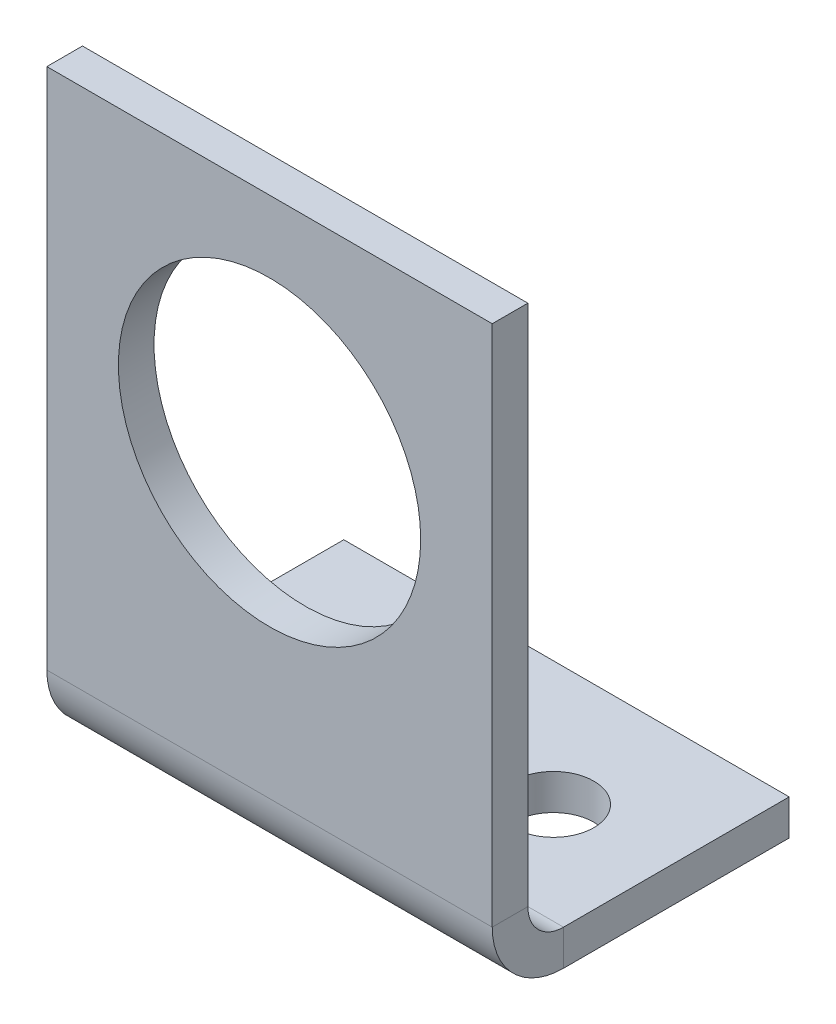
ISO-10303-21;
HEADER;
FILE_DESCRIPTION(('STEP AP214'),'2;1');
FILE_NAME('part.step','',(''),(''),'','','');
FILE_SCHEMA(('AUTOMOTIVE_DESIGN { 1 0 10303 214 1 1 1 1 }'));
ENDSEC;
DATA;
#1=APPLICATION_CONTEXT('core data for automotive mechanical design processes');
#2=APPLICATION_PROTOCOL_DEFINITION('international standard','automotive_design',2000,#1);
#3=PRODUCT_CONTEXT('',#1,'mechanical');
#4=PRODUCT('Part','Part','',(#3));
#5=PRODUCT_RELATED_PRODUCT_CATEGORY('part','',(#4));
#6=PRODUCT_DEFINITION_FORMATION('','',#4);
#7=PRODUCT_DEFINITION_CONTEXT('part definition',#1,'design');
#8=PRODUCT_DEFINITION('design','',#6,#7);
#9=PRODUCT_DEFINITION_SHAPE('','',#8);
#10=(LENGTH_UNIT() NAMED_UNIT(*) SI_UNIT(.MILLI.,.METRE.));
#11=(NAMED_UNIT(*) PLANE_ANGLE_UNIT() SI_UNIT($,.RADIAN.));
#12=(NAMED_UNIT(*) SI_UNIT($,.STERADIAN.) SOLID_ANGLE_UNIT());
#13=UNCERTAINTY_MEASURE_WITH_UNIT(LENGTH_MEASURE(1.E-05),#10,'distance_accuracy_value','');
#14=(GEOMETRIC_REPRESENTATION_CONTEXT(3) GLOBAL_UNCERTAINTY_ASSIGNED_CONTEXT((#13)) GLOBAL_UNIT_ASSIGNED_CONTEXT((#10,
#11,#12)) REPRESENTATION_CONTEXT('',''));
#15=CARTESIAN_POINT('',(0.,0.,0.));
#16=DIRECTION('',(0.,0.,1.));
#17=DIRECTION('',(1.,0.,0.));
#18=AXIS2_PLACEMENT_3D('',#15,#16,#17);
#19=CARTESIAN_POINT('',(9.525,3.048,0.));
#20=DIRECTION('',(1.,0.,0.));
#21=DIRECTION('',(0.,0.,-1.));
#22=AXIS2_PLACEMENT_3D('',#19,#20,#21);
#23=PLANE('',#22);
#24=DIRECTION('',(0.,0.,-1.));
#25=VECTOR('',#24,1.);
#26=CARTESIAN_POINT('',(9.525,3.048,0.));
#27=LINE('',#26,#25);
#28=CARTESIAN_POINT('',(9.525,3.048,0.));
#29=VERTEX_POINT('',#28);
#30=CARTESIAN_POINT('',(9.525,3.048,-1.524));
#31=VERTEX_POINT('',#30);
#32=EDGE_CURVE('E11',#29,#31,#27,.T.);
#33=ORIENTED_EDGE('',*,*,#32,.F.);
#34=CARTESIAN_POINT('',(9.525,3.048,-3.048));
#35=DIRECTION('',(1.,0.,0.));
#36=DIRECTION('',(0.,0.,-1.));
#37=AXIS2_PLACEMENT_3D('',#34,#35,#36);
#38=CIRCLE('',#37,3.048);
#39=CARTESIAN_POINT('',(9.525,0.,-3.048));
#40=VERTEX_POINT('',#39);
#41=EDGE_CURVE('E134',#40,#29,#38,.F.);
#42=ORIENTED_EDGE('',*,*,#41,.F.);
#43=DIRECTION('',(0.,-1.,0.));
#44=VECTOR('',#43,1.);
#45=CARTESIAN_POINT('',(9.525,1.524,-3.048));
#46=LINE('',#45,#44);
#47=CARTESIAN_POINT('',(9.525,1.524,-3.048));
#48=VERTEX_POINT('',#47);
#49=EDGE_CURVE('E45',#48,#40,#46,.T.);
#50=ORIENTED_EDGE('',*,*,#49,.F.);
#51=CARTESIAN_POINT('',(9.525,3.048,-3.048));
#52=DIRECTION('',(1.,0.,0.));
#53=DIRECTION('',(0.,0.,-1.));
#54=AXIS2_PLACEMENT_3D('',#51,#52,#53);
#55=CIRCLE('',#54,1.524);
#56=EDGE_CURVE('E127',#48,#31,#55,.F.);
#57=ORIENTED_EDGE('',*,*,#56,.T.);
#58=EDGE_LOOP('',(#33,#42,#50,#57));
#59=FACE_BOUND('',#58,.T.);
#60=ADVANCED_FACE('F37',(#59),#23,.T.);
#61=CARTESIAN_POINT('',(9.525,1.524,-3.048));
#62=DIRECTION('',(1.,0.,0.));
#63=DIRECTION('',(0.,0.,-1.));
#64=AXIS2_PLACEMENT_3D('',#61,#62,#63);
#65=PLANE('',#64);
#66=DIRECTION('',(0.,1.,0.));
#67=VECTOR('',#66,1.);
#68=CARTESIAN_POINT('',(9.525,0.,0.));
#69=LINE('',#68,#67);
#70=CARTESIAN_POINT('',(9.525,25.4,0.));
#71=VERTEX_POINT('',#70);
#72=EDGE_CURVE('E184',#29,#71,#69,.T.);
#73=ORIENTED_EDGE('',*,*,#72,.F.);
#74=ORIENTED_EDGE('',*,*,#32,.T.);
#75=DIRECTION('',(0.,1.,0.));
#76=VECTOR('',#75,1.);
#77=CARTESIAN_POINT('',(9.525,0.,-1.524));
#78=LINE('',#77,#76);
#79=CARTESIAN_POINT('',(9.525,25.4,-1.524));
#80=VERTEX_POINT('',#79);
#81=EDGE_CURVE('E93',#31,#80,#78,.T.);
#82=ORIENTED_EDGE('',*,*,#81,.T.);
#83=DIRECTION('',(0.,0.,-1.));
#84=VECTOR('',#83,1.);
#85=CARTESIAN_POINT('',(9.525,25.4,0.));
#86=LINE('',#85,#84);
#87=EDGE_CURVE('E398',#71,#80,#86,.T.);
#88=ORIENTED_EDGE('',*,*,#87,.F.);
#89=EDGE_LOOP('',(#73,#74,#82,#88));
#90=FACE_BOUND('',#89,.T.);
#91=ADVANCED_FACE('F192',(#90),#65,.T.);
#92=CARTESIAN_POINT('',(-9.525,0.,-3.048));
#93=DIRECTION('',(-1.,0.,0.));
#94=DIRECTION('',(0.,0.,1.));
#95=AXIS2_PLACEMENT_3D('',#92,#93,#94);
#96=PLANE('',#95);
#97=DIRECTION('',(0.,1.,0.));
#98=VECTOR('',#97,1.);
#99=CARTESIAN_POINT('',(-9.525,0.,-3.048));
#100=LINE('',#99,#98);
#101=CARTESIAN_POINT('',(-9.525,0.,-3.048));
#102=VERTEX_POINT('',#101);
#103=CARTESIAN_POINT('',(-9.525,1.524,-3.048));
#104=VERTEX_POINT('',#103);
#105=EDGE_CURVE('E80',#102,#104,#100,.T.);
#106=ORIENTED_EDGE('',*,*,#105,.F.);
#107=CARTESIAN_POINT('',(-9.525,3.048,-3.048));
#108=DIRECTION('',(1.,0.,0.));
#109=DIRECTION('',(0.,0.,-1.));
#110=AXIS2_PLACEMENT_3D('',#107,#108,#109);
#111=CIRCLE('',#110,3.048);
#112=CARTESIAN_POINT('',(-9.525,3.048,0.));
#113=VERTEX_POINT('',#112);
#114=EDGE_CURVE('E150',#102,#113,#111,.F.);
#115=ORIENTED_EDGE('',*,*,#114,.T.);
#116=DIRECTION('',(0.,0.,1.));
#117=VECTOR('',#116,1.);
#118=CARTESIAN_POINT('',(-9.525,3.048,-1.524));
#119=LINE('',#118,#117);
#120=CARTESIAN_POINT('',(-9.525,3.048,-1.524));
#121=VERTEX_POINT('',#120);
#122=EDGE_CURVE('E87',#121,#113,#119,.T.);
#123=ORIENTED_EDGE('',*,*,#122,.F.);
#124=CARTESIAN_POINT('',(-9.525,3.048,-3.048));
#125=DIRECTION('',(1.,0.,0.));
#126=DIRECTION('',(0.,0.,-1.));
#127=AXIS2_PLACEMENT_3D('',#124,#125,#126);
#128=CIRCLE('',#127,1.524);
#129=EDGE_CURVE('E157',#104,#121,#128,.F.);
#130=ORIENTED_EDGE('',*,*,#129,.F.);
#131=EDGE_LOOP('',(#106,#115,#123,#130));
#132=FACE_BOUND('',#131,.T.);
#133=ADVANCED_FACE('F190',(#132),#96,.T.);
#134=CARTESIAN_POINT('',(-9.525,3.048,-1.524));
#135=DIRECTION('',(-1.,0.,0.));
#136=DIRECTION('',(0.,0.,1.));
#137=AXIS2_PLACEMENT_3D('',#134,#135,#136);
#138=PLANE('',#137);
#139=DIRECTION('',(0.,0.,1.));
#140=VECTOR('',#139,1.);
#141=CARTESIAN_POINT('',(-9.525,0.,0.));
#142=LINE('',#141,#140);
#143=CARTESIAN_POINT('',(-9.525,0.,-12.7));
#144=VERTEX_POINT('',#143);
#145=EDGE_CURVE('E152',#144,#102,#142,.T.);
#146=ORIENTED_EDGE('',*,*,#145,.T.);
#147=ORIENTED_EDGE('',*,*,#105,.T.);
#148=DIRECTION('',(0.,0.,-1.));
#149=VECTOR('',#148,1.);
#150=CARTESIAN_POINT('',(-9.525,1.524,0.));
#151=LINE('',#150,#149);
#152=CARTESIAN_POINT('',(-9.525,1.524,-12.7));
#153=VERTEX_POINT('',#152);
#154=EDGE_CURVE('E155',#153,#104,#151,.F.);
#155=ORIENTED_EDGE('',*,*,#154,.F.);
#156=DIRECTION('',(0.,-1.,0.));
#157=VECTOR('',#156,1.);
#158=CARTESIAN_POINT('',(-9.525,1.524,-12.7));
#159=LINE('',#158,#157);
#160=EDGE_CURVE('E115',#153,#144,#159,.T.);
#161=ORIENTED_EDGE('',*,*,#160,.T.);
#162=EDGE_LOOP('',(#146,#147,#155,#161));
#163=FACE_BOUND('',#162,.T.);
#164=ADVANCED_FACE('F186',(#163),#138,.T.);
#165=CARTESIAN_POINT('',(9.525,0.,-1.524));
#166=DIRECTION('',(0.,0.,1.));
#167=DIRECTION('',(1.,0.,0.));
#168=AXIS2_PLACEMENT_3D('',#165,#166,#167);
#169=PLANE('',#168);
#170=CARTESIAN_POINT('',(0.,15.875,-1.524));
#171=DIRECTION('',(0.,0.,1.));
#172=DIRECTION('',(1.,0.,0.));
#173=AXIS2_PLACEMENT_3D('',#170,#171,#172);
#174=CIRCLE('',#173,6.4643);
#175=CARTESIAN_POINT('',(6.4643,15.875,-1.524));
#176=VERTEX_POINT('',#175);
#177=EDGE_CURVE('E144',#176,#176,#174,.T.);
#178=ORIENTED_EDGE('',*,*,#177,.T.);
#179=EDGE_LOOP('',(#178));
#180=FACE_BOUND('',#179,.T.);
#181=DIRECTION('',(0.,1.,0.));
#182=VECTOR('',#181,1.);
#183=CARTESIAN_POINT('',(-9.525,0.,-1.524));
#184=LINE('',#183,#182);
#185=CARTESIAN_POINT('',(-9.525,25.4,-1.524));
#186=VERTEX_POINT('',#185);
#187=EDGE_CURVE('E140',#121,#186,#184,.T.);
#188=ORIENTED_EDGE('',*,*,#187,.T.);
#189=DIRECTION('',(-1.,0.,0.));
#190=VECTOR('',#189,1.);
#191=CARTESIAN_POINT('',(9.525,25.4,-1.524));
#192=LINE('',#191,#190);
#193=EDGE_CURVE('E171',#80,#186,#192,.T.);
#194=ORIENTED_EDGE('',*,*,#193,.F.);
#195=ORIENTED_EDGE('',*,*,#81,.F.);
#196=DIRECTION('',(-1.,0.,0.));
#197=VECTOR('',#196,1.);
#198=CARTESIAN_POINT('',(9.525,3.048,-1.524));
#199=LINE('',#198,#197);
#200=EDGE_CURVE('E139',#31,#121,#199,.T.);
#201=ORIENTED_EDGE('',*,*,#200,.T.);
#202=EDGE_LOOP('',(#188,#194,#195,#201));
#203=FACE_BOUND('',#202,.T.);
#204=ADVANCED_FACE('F198',(#180,#203),#169,.F.);
#205=CARTESIAN_POINT('',(9.525,25.4,0.));
#206=DIRECTION('',(0.,1.,0.));
#207=DIRECTION('',(0.,0.,1.));
#208=AXIS2_PLACEMENT_3D('',#205,#206,#207);
#209=PLANE('',#208);
#210=DIRECTION('',(0.,0.,-1.));
#211=VECTOR('',#210,1.);
#212=CARTESIAN_POINT('',(-9.525,25.4,0.));
#213=LINE('',#212,#211);
#214=CARTESIAN_POINT('',(-9.525,25.4,0.));
#215=VERTEX_POINT('',#214);
#216=EDGE_CURVE('E143',#215,#186,#213,.T.);
#217=ORIENTED_EDGE('',*,*,#216,.F.);
#218=DIRECTION('',(-1.,0.,0.));
#219=VECTOR('',#218,1.);
#220=CARTESIAN_POINT('',(9.525,25.4,0.));
#221=LINE('',#220,#219);
#222=EDGE_CURVE('E169',#71,#215,#221,.T.);
#223=ORIENTED_EDGE('',*,*,#222,.F.);
#224=ORIENTED_EDGE('',*,*,#87,.T.);
#225=ORIENTED_EDGE('',*,*,#193,.T.);
#226=EDGE_LOOP('',(#217,#223,#224,#225));
#227=FACE_BOUND('',#226,.T.);
#228=ADVANCED_FACE('F227',(#227),#209,.T.);
#229=CARTESIAN_POINT('',(9.525,0.,0.));
#230=DIRECTION('',(0.,0.,1.));
#231=DIRECTION('',(1.,0.,0.));
#232=AXIS2_PLACEMENT_3D('',#229,#230,#231);
#233=PLANE('',#232);
#234=CARTESIAN_POINT('',(0.,15.875,0.));
#235=DIRECTION('',(0.,0.,1.));
#236=DIRECTION('',(1.,0.,0.));
#237=AXIS2_PLACEMENT_3D('',#234,#235,#236);
#238=CIRCLE('',#237,6.4643);
#239=CARTESIAN_POINT('',(6.4643,15.875,0.));
#240=VERTEX_POINT('',#239);
#241=EDGE_CURVE('E390',#240,#240,#238,.T.);
#242=ORIENTED_EDGE('',*,*,#241,.F.);
#243=EDGE_LOOP('',(#242));
#244=FACE_BOUND('',#243,.T.);
#245=DIRECTION('',(0.,1.,0.));
#246=VECTOR('',#245,1.);
#247=CARTESIAN_POINT('',(-9.525,0.,0.));
#248=LINE('',#247,#246);
#249=EDGE_CURVE('E147',#113,#215,#248,.T.);
#250=ORIENTED_EDGE('',*,*,#249,.F.);
#251=DIRECTION('',(-1.,0.,0.));
#252=VECTOR('',#251,1.);
#253=CARTESIAN_POINT('',(9.525,3.048,0.));
#254=LINE('',#253,#252);
#255=EDGE_CURVE('E166',#29,#113,#254,.T.);
#256=ORIENTED_EDGE('',*,*,#255,.F.);
#257=ORIENTED_EDGE('',*,*,#72,.T.);
#258=ORIENTED_EDGE('',*,*,#222,.T.);
#259=EDGE_LOOP('',(#250,#256,#257,#258));
#260=FACE_BOUND('',#259,.T.);
#261=ADVANCED_FACE('F232',(#244,#260),#233,.T.);
#262=CARTESIAN_POINT('',(9.525,3.048,-3.048));
#263=DIRECTION('',(-1.,0.,0.));
#264=DIRECTION('',(0.,0.,1.));
#265=AXIS2_PLACEMENT_3D('',#262,#263,#264);
#266=CYLINDRICAL_SURFACE('',#265,3.048);
#267=ORIENTED_EDGE('',*,*,#114,.F.);
#268=DIRECTION('',(-1.,0.,0.));
#269=VECTOR('',#268,1.);
#270=CARTESIAN_POINT('',(9.525,0.,-3.048));
#271=LINE('',#270,#269);
#272=EDGE_CURVE('E163',#40,#102,#271,.T.);
#273=ORIENTED_EDGE('',*,*,#272,.F.);
#274=ORIENTED_EDGE('',*,*,#41,.T.);
#275=ORIENTED_EDGE('',*,*,#255,.T.);
#276=EDGE_LOOP('',(#267,#273,#274,#275));
#277=FACE_BOUND('',#276,.T.);
#278=ADVANCED_FACE('F180',(#277),#266,.T.);
#279=CARTESIAN_POINT('',(9.525,0.,0.));
#280=DIRECTION('',(0.,-1.,0.));
#281=DIRECTION('',(0.,0.,-1.));
#282=AXIS2_PLACEMENT_3D('',#279,#280,#281);
#283=PLANE('',#282);
#284=CARTESIAN_POINT('',(-4.7625,0.,-7.38068990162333));
#285=DIRECTION('',(0.,-1.,0.));
#286=DIRECTION('',(0.,0.,-1.));
#287=AXIS2_PLACEMENT_3D('',#284,#285,#286);
#288=CIRCLE('',#287,1.7272);
#289=CARTESIAN_POINT('',(-4.7625,0.,-9.10788990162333));
#290=VERTEX_POINT('',#289);
#291=EDGE_CURVE('E382',#290,#290,#288,.T.);
#292=ORIENTED_EDGE('',*,*,#291,.F.);
#293=EDGE_LOOP('',(#292));
#294=FACE_BOUND('',#293,.T.);
#295=CARTESIAN_POINT('',(4.7625,0.,-7.38068990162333));
#296=DIRECTION('',(0.,-1.,0.));
#297=DIRECTION('',(0.,0.,-1.));
#298=AXIS2_PLACEMENT_3D('',#295,#296,#297);
#299=CIRCLE('',#298,1.7272);
#300=CARTESIAN_POINT('',(4.7625,0.,-9.10788990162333));
#301=VERTEX_POINT('',#300);
#302=EDGE_CURVE('E384',#301,#301,#299,.T.);
#303=ORIENTED_EDGE('',*,*,#302,.F.);
#304=EDGE_LOOP('',(#303));
#305=FACE_BOUND('',#304,.T.);
#306=ORIENTED_EDGE('',*,*,#145,.F.);
#307=DIRECTION('',(-1.,0.,0.));
#308=VECTOR('',#307,1.);
#309=CARTESIAN_POINT('',(9.525,0.,-12.7));
#310=LINE('',#309,#308);
#311=CARTESIAN_POINT('',(9.525,0.,-12.7));
#312=VERTEX_POINT('',#311);
#313=EDGE_CURVE('E117',#312,#144,#310,.T.);
#314=ORIENTED_EDGE('',*,*,#313,.F.);
#315=DIRECTION('',(0.,0.,1.));
#316=VECTOR('',#315,1.);
#317=CARTESIAN_POINT('',(9.525,0.,0.));
#318=LINE('',#317,#316);
#319=EDGE_CURVE('E132',#312,#40,#318,.T.);
#320=ORIENTED_EDGE('',*,*,#319,.T.);
#321=ORIENTED_EDGE('',*,*,#272,.T.);
#322=EDGE_LOOP('',(#306,#314,#320,#321));
#323=FACE_BOUND('',#322,.T.);
#324=ADVANCED_FACE('F185',(#294,#305,#323),#283,.T.);
#325=CARTESIAN_POINT('',(9.525,1.524,-12.7));
#326=DIRECTION('',(0.,0.,-1.));
#327=DIRECTION('',(0.,1.,0.));
#328=AXIS2_PLACEMENT_3D('',#325,#326,#327);
#329=PLANE('',#328);
#330=ORIENTED_EDGE('',*,*,#160,.F.);
#331=DIRECTION('',(-1.,0.,0.));
#332=VECTOR('',#331,1.);
#333=CARTESIAN_POINT('',(9.525,1.524,-12.7));
#334=LINE('',#333,#332);
#335=CARTESIAN_POINT('',(9.525,1.524,-12.7));
#336=VERTEX_POINT('',#335);
#337=EDGE_CURVE('E109',#336,#153,#334,.T.);
#338=ORIENTED_EDGE('',*,*,#337,.F.);
#339=DIRECTION('',(0.,-1.,0.));
#340=VECTOR('',#339,1.);
#341=CARTESIAN_POINT('',(9.525,1.524,-12.7));
#342=LINE('',#341,#340);
#343=EDGE_CURVE('E113',#336,#312,#342,.T.);
#344=ORIENTED_EDGE('',*,*,#343,.T.);
#345=ORIENTED_EDGE('',*,*,#313,.T.);
#346=EDGE_LOOP('',(#330,#338,#344,#345));
#347=FACE_BOUND('',#346,.T.);
#348=ADVANCED_FACE('F111',(#347),#329,.T.);
#349=CARTESIAN_POINT('',(9.525,1.524,0.));
#350=DIRECTION('',(0.,-1.,0.));
#351=DIRECTION('',(0.,0.,-1.));
#352=AXIS2_PLACEMENT_3D('',#349,#350,#351);
#353=PLANE('',#352);
#354=CARTESIAN_POINT('',(-4.7625,1.524,-7.38068990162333));
#355=DIRECTION('',(0.,-1.,0.));
#356=DIRECTION('',(0.,0.,-1.));
#357=AXIS2_PLACEMENT_3D('',#354,#355,#356);
#358=CIRCLE('',#357,1.7272);
#359=CARTESIAN_POINT('',(-4.7625,1.524,-9.10788990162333));
#360=VERTEX_POINT('',#359);
#361=EDGE_CURVE('E379',#360,#360,#358,.T.);
#362=ORIENTED_EDGE('',*,*,#361,.T.);
#363=EDGE_LOOP('',(#362));
#364=FACE_BOUND('',#363,.T.);
#365=CARTESIAN_POINT('',(4.7625,1.524,-7.38068990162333));
#366=DIRECTION('',(0.,-1.,0.));
#367=DIRECTION('',(0.,0.,-1.));
#368=AXIS2_PLACEMENT_3D('',#365,#366,#367);
#369=CIRCLE('',#368,1.7272);
#370=CARTESIAN_POINT('',(4.7625,1.524,-9.10788990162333));
#371=VERTEX_POINT('',#370);
#372=EDGE_CURVE('E387',#371,#371,#369,.T.);
#373=ORIENTED_EDGE('',*,*,#372,.T.);
#374=EDGE_LOOP('',(#373));
#375=FACE_BOUND('',#374,.T.);
#376=ORIENTED_EDGE('',*,*,#154,.T.);
#377=DIRECTION('',(-1.,0.,0.));
#378=VECTOR('',#377,1.);
#379=CARTESIAN_POINT('',(9.525,1.524,-3.048));
#380=LINE('',#379,#378);
#381=EDGE_CURVE('E118',#48,#104,#380,.T.);
#382=ORIENTED_EDGE('',*,*,#381,.F.);
#383=DIRECTION('',(0.,0.,-1.));
#384=VECTOR('',#383,1.);
#385=CARTESIAN_POINT('',(9.525,1.524,0.));
#386=LINE('',#385,#384);
#387=EDGE_CURVE('E122',#336,#48,#386,.F.);
#388=ORIENTED_EDGE('',*,*,#387,.F.);
#389=ORIENTED_EDGE('',*,*,#337,.T.);
#390=EDGE_LOOP('',(#376,#382,#388,#389));
#391=FACE_BOUND('',#390,.T.);
#392=ADVANCED_FACE('F123',(#364,#375,#391),#353,.F.);
#393=CARTESIAN_POINT('',(9.525,3.048,-3.048));
#394=DIRECTION('',(-1.,0.,0.));
#395=DIRECTION('',(0.,0.,1.));
#396=AXIS2_PLACEMENT_3D('',#393,#394,#395);
#397=CYLINDRICAL_SURFACE('',#396,1.524);
#398=ORIENTED_EDGE('',*,*,#129,.T.);
#399=ORIENTED_EDGE('',*,*,#200,.F.);
#400=ORIENTED_EDGE('',*,*,#56,.F.);
#401=ORIENTED_EDGE('',*,*,#381,.T.);
#402=EDGE_LOOP('',(#398,#399,#400,#401));
#403=FACE_BOUND('',#402,.T.);
#404=ADVANCED_FACE('F188',(#403),#397,.F.);
#405=CARTESIAN_POINT('',(9.525,3.048,-3.048));
#406=DIRECTION('',(1.,0.,0.));
#407=DIRECTION('',(0.,0.,-1.));
#408=AXIS2_PLACEMENT_3D('',#405,#406,#407);
#409=PLANE('',#408);
#410=ORIENTED_EDGE('',*,*,#387,.T.);
#411=ORIENTED_EDGE('',*,*,#49,.T.);
#412=ORIENTED_EDGE('',*,*,#319,.F.);
#413=ORIENTED_EDGE('',*,*,#343,.F.);
#414=EDGE_LOOP('',(#410,#411,#412,#413));
#415=FACE_BOUND('',#414,.T.);
#416=ADVANCED_FACE('F130',(#415),#409,.T.);
#417=CARTESIAN_POINT('',(-9.525,3.048,-3.048));
#418=DIRECTION('',(1.,0.,0.));
#419=DIRECTION('',(0.,0.,-1.));
#420=AXIS2_PLACEMENT_3D('',#417,#418,#419);
#421=PLANE('',#420);
#422=ORIENTED_EDGE('',*,*,#187,.F.);
#423=ORIENTED_EDGE('',*,*,#122,.T.);
#424=ORIENTED_EDGE('',*,*,#249,.T.);
#425=ORIENTED_EDGE('',*,*,#216,.T.);
#426=EDGE_LOOP('',(#422,#423,#424,#425));
#427=FACE_BOUND('',#426,.T.);
#428=ADVANCED_FACE('F276',(#427),#421,.F.);
#429=CARTESIAN_POINT('',(0.,15.875,-1.524));
#430=DIRECTION('',(0.,0.,1.));
#431=DIRECTION('',(1.,0.,0.));
#432=AXIS2_PLACEMENT_3D('',#429,#430,#431);
#433=CYLINDRICAL_SURFACE('',#432,6.4643);
#434=CARTESIAN_POINT('',(6.4643,15.875,-1.524));
#435=CARTESIAN_POINT('',(6.4643,15.875,-1.508125));
#436=CARTESIAN_POINT('',(6.4643,15.875,-1.49225));
#437=CARTESIAN_POINT('',(6.4643,15.875,-1.4605));
#438=CARTESIAN_POINT('',(6.4643,15.875,-1.444625));
#439=CARTESIAN_POINT('',(6.4643,15.875,-1.412875));
#440=CARTESIAN_POINT('',(6.4643,15.875,-1.397));
#441=CARTESIAN_POINT('',(6.4643,15.875,-1.36525));
#442=CARTESIAN_POINT('',(6.4643,15.875,-1.349375));
#443=CARTESIAN_POINT('',(6.4643,15.875,-1.317625));
#444=CARTESIAN_POINT('',(6.4643,15.875,-1.30175));
#445=CARTESIAN_POINT('',(6.4643,15.875,-1.27));
#446=CARTESIAN_POINT('',(6.4643,15.875,-1.254125));
#447=CARTESIAN_POINT('',(6.4643,15.875,-1.222375));
#448=CARTESIAN_POINT('',(6.4643,15.875,-1.2065));
#449=CARTESIAN_POINT('',(6.4643,15.875,-1.17475));
#450=CARTESIAN_POINT('',(6.4643,15.875,-1.158875));
#451=CARTESIAN_POINT('',(6.4643,15.875,-1.127125));
#452=CARTESIAN_POINT('',(6.4643,15.875,-1.11125));
#453=CARTESIAN_POINT('',(6.4643,15.875,-1.0795));
#454=CARTESIAN_POINT('',(6.4643,15.875,-1.063625));
#455=CARTESIAN_POINT('',(6.4643,15.875,-1.031875));
#456=CARTESIAN_POINT('',(6.4643,15.875,-1.016));
#457=CARTESIAN_POINT('',(6.4643,15.875,-0.98425));
#458=CARTESIAN_POINT('',(6.4643,15.875,-0.968375));
#459=CARTESIAN_POINT('',(6.4643,15.875,-0.936625));
#460=CARTESIAN_POINT('',(6.4643,15.875,-0.92075));
#461=CARTESIAN_POINT('',(6.4643,15.875,-0.889));
#462=CARTESIAN_POINT('',(6.4643,15.875,-0.873125));
#463=CARTESIAN_POINT('',(6.4643,15.875,-0.841375));
#464=CARTESIAN_POINT('',(6.4643,15.875,-0.8255));
#465=CARTESIAN_POINT('',(6.4643,15.875,-0.79375));
#466=CARTESIAN_POINT('',(6.4643,15.875,-0.777875));
#467=CARTESIAN_POINT('',(6.4643,15.875,-0.746125));
#468=CARTESIAN_POINT('',(6.4643,15.875,-0.73025));
#469=CARTESIAN_POINT('',(6.4643,15.875,-0.6985));
#470=CARTESIAN_POINT('',(6.4643,15.875,-0.682625));
#471=CARTESIAN_POINT('',(6.4643,15.875,-0.650875));
#472=CARTESIAN_POINT('',(6.4643,15.875,-0.635));
#473=CARTESIAN_POINT('',(6.4643,15.875,-0.60325));
#474=CARTESIAN_POINT('',(6.4643,15.875,-0.587375));
#475=CARTESIAN_POINT('',(6.4643,15.875,-0.555625));
#476=CARTESIAN_POINT('',(6.4643,15.875,-0.53975));
#477=CARTESIAN_POINT('',(6.4643,15.875,-0.508));
#478=CARTESIAN_POINT('',(6.4643,15.875,-0.492125));
#479=CARTESIAN_POINT('',(6.4643,15.875,-0.460375));
#480=CARTESIAN_POINT('',(6.4643,15.875,-0.4445));
#481=CARTESIAN_POINT('',(6.4643,15.875,-0.41275));
#482=CARTESIAN_POINT('',(6.4643,15.875,-0.396875));
#483=CARTESIAN_POINT('',(6.4643,15.875,-0.365125));
#484=CARTESIAN_POINT('',(6.4643,15.875,-0.34925));
#485=CARTESIAN_POINT('',(6.4643,15.875,-0.3175));
#486=CARTESIAN_POINT('',(6.4643,15.875,-0.301625));
#487=CARTESIAN_POINT('',(6.4643,15.875,-0.269875));
#488=CARTESIAN_POINT('',(6.4643,15.875,-0.254));
#489=CARTESIAN_POINT('',(6.4643,15.875,-0.22225));
#490=CARTESIAN_POINT('',(6.4643,15.875,-0.206375));
#491=CARTESIAN_POINT('',(6.4643,15.875,-0.174625));
#492=CARTESIAN_POINT('',(6.4643,15.875,-0.15875));
#493=CARTESIAN_POINT('',(6.4643,15.875,-0.127));
#494=CARTESIAN_POINT('',(6.4643,15.875,-0.111125));
#495=CARTESIAN_POINT('',(6.4643,15.875,-0.079375));
#496=CARTESIAN_POINT('',(6.4643,15.875,-0.0635));
#497=CARTESIAN_POINT('',(6.4643,15.875,-0.0317499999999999));
#498=CARTESIAN_POINT('',(6.4643,15.875,-0.015875));
#499=CARTESIAN_POINT('',(6.4643,15.875,0.));
#500=B_SPLINE_CURVE_WITH_KNOTS('',3,(#434,#435,#436,#437,#438,#439,#440,#441,#442,#443,#444,
#445,#446,#447,#448,#449,#450,#451,#452,#453,#454,#455,#456,#457,#458,#459,#460,#461,#462,#463,
#464,#465,#466,#467,#468,#469,#470,#471,#472,#473,#474,#475,#476,#477,#478,#479,#480,#481,#482,
#483,#484,#485,#486,#487,#488,#489,#490,#491,#492,#493,#494,#495,#496,#497,#498,#499),
.UNSPECIFIED.,.F.,.F.,(4,2,2,2,2,2,2,2,2,2,2,2,2,2,2,2,2,2,2,2,2,2,2,2,2,2,2,2,2,2,2,2,4),(0.,
0.0476250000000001,0.0952500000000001,0.142875,0.1905,0.238125,0.28575,0.333375,0.381,0.428625,
0.47625,0.523875,0.5715,0.619125,0.66675,0.714375,0.762,0.809625,0.85725,0.904875,0.9525,
1.000125,1.04775,1.095375,1.143,1.190625,1.23825,1.285875,1.3335,1.381125,1.42875,1.476375,
1.524),.UNSPECIFIED.);
#501=EDGE_CURVE('BSEAM286',#176,#240,#500,.T.);
#502=ORIENTED_EDGE('',*,*,#177,.F.);
#503=ORIENTED_EDGE('',*,*,#241,.T.);
#504=ORIENTED_EDGE('',*,*,#501,.T.);
#505=ORIENTED_EDGE('',*,*,#501,.F.);
#506=EDGE_LOOP('',(#502,#504,#503,#505));
#507=FACE_BOUND('',#506,.T.);
#508=ADVANCED_FACE('F286',(#507),#433,.F.);
#509=CARTESIAN_POINT('',(4.7625,1.524,-7.38068990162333));
#510=DIRECTION('',(0.,-1.,0.));
#511=DIRECTION('',(0.,0.,-1.));
#512=AXIS2_PLACEMENT_3D('',#509,#510,#511);
#513=CYLINDRICAL_SURFACE('',#512,1.7272);
#514=CARTESIAN_POINT('',(4.7625,1.524,-9.10788990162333));
#515=CARTESIAN_POINT('',(4.7625,1.508125,-9.10788990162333));
#516=CARTESIAN_POINT('',(4.7625,1.49225,-9.10788990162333));
#517=CARTESIAN_POINT('',(4.7625,1.4605,-9.10788990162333));
#518=CARTESIAN_POINT('',(4.7625,1.444625,-9.10788990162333));
#519=CARTESIAN_POINT('',(4.7625,1.412875,-9.10788990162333));
#520=CARTESIAN_POINT('',(4.7625,1.397,-9.10788990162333));
#521=CARTESIAN_POINT('',(4.7625,1.36525,-9.10788990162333));
#522=CARTESIAN_POINT('',(4.7625,1.349375,-9.10788990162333));
#523=CARTESIAN_POINT('',(4.7625,1.317625,-9.10788990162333));
#524=CARTESIAN_POINT('',(4.7625,1.30175,-9.10788990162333));
#525=CARTESIAN_POINT('',(4.7625,1.27,-9.10788990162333));
#526=CARTESIAN_POINT('',(4.7625,1.254125,-9.10788990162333));
#527=CARTESIAN_POINT('',(4.7625,1.222375,-9.10788990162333));
#528=CARTESIAN_POINT('',(4.7625,1.2065,-9.10788990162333));
#529=CARTESIAN_POINT('',(4.7625,1.17475,-9.10788990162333));
#530=CARTESIAN_POINT('',(4.7625,1.158875,-9.10788990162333));
#531=CARTESIAN_POINT('',(4.7625,1.127125,-9.10788990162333));
#532=CARTESIAN_POINT('',(4.7625,1.11125,-9.10788990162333));
#533=CARTESIAN_POINT('',(4.7625,1.0795,-9.10788990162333));
#534=CARTESIAN_POINT('',(4.7625,1.063625,-9.10788990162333));
#535=CARTESIAN_POINT('',(4.7625,1.031875,-9.10788990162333));
#536=CARTESIAN_POINT('',(4.7625,1.016,-9.10788990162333));
#537=CARTESIAN_POINT('',(4.7625,0.98425,-9.10788990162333));
#538=CARTESIAN_POINT('',(4.7625,0.968375,-9.10788990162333));
#539=CARTESIAN_POINT('',(4.7625,0.936625,-9.10788990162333));
#540=CARTESIAN_POINT('',(4.7625,0.92075,-9.10788990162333));
#541=CARTESIAN_POINT('',(4.7625,0.889,-9.10788990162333));
#542=CARTESIAN_POINT('',(4.7625,0.873125,-9.10788990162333));
#543=CARTESIAN_POINT('',(4.7625,0.841375,-9.10788990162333));
#544=CARTESIAN_POINT('',(4.7625,0.8255,-9.10788990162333));
#545=CARTESIAN_POINT('',(4.7625,0.79375,-9.10788990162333));
#546=CARTESIAN_POINT('',(4.7625,0.777875,-9.10788990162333));
#547=CARTESIAN_POINT('',(4.7625,0.746125,-9.10788990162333));
#548=CARTESIAN_POINT('',(4.7625,0.73025,-9.10788990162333));
#549=CARTESIAN_POINT('',(4.7625,0.6985,-9.10788990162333));
#550=CARTESIAN_POINT('',(4.7625,0.682625,-9.10788990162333));
#551=CARTESIAN_POINT('',(4.7625,0.650875,-9.10788990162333));
#552=CARTESIAN_POINT('',(4.7625,0.635,-9.10788990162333));
#553=CARTESIAN_POINT('',(4.7625,0.60325,-9.10788990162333));
#554=CARTESIAN_POINT('',(4.7625,0.587375,-9.10788990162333));
#555=CARTESIAN_POINT('',(4.7625,0.555625,-9.10788990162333));
#556=CARTESIAN_POINT('',(4.7625,0.53975,-9.10788990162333));
#557=CARTESIAN_POINT('',(4.7625,0.508,-9.10788990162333));
#558=CARTESIAN_POINT('',(4.7625,0.492125,-9.10788990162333));
#559=CARTESIAN_POINT('',(4.7625,0.460375,-9.10788990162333));
#560=CARTESIAN_POINT('',(4.7625,0.4445,-9.10788990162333));
#561=CARTESIAN_POINT('',(4.7625,0.41275,-9.10788990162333));
#562=CARTESIAN_POINT('',(4.7625,0.396875,-9.10788990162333));
#563=CARTESIAN_POINT('',(4.7625,0.365125,-9.10788990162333));
#564=CARTESIAN_POINT('',(4.7625,0.34925,-9.10788990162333));
#565=CARTESIAN_POINT('',(4.7625,0.3175,-9.10788990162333));
#566=CARTESIAN_POINT('',(4.7625,0.301625,-9.10788990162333));
#567=CARTESIAN_POINT('',(4.7625,0.269875,-9.10788990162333));
#568=CARTESIAN_POINT('',(4.7625,0.254,-9.10788990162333));
#569=CARTESIAN_POINT('',(4.7625,0.22225,-9.10788990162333));
#570=CARTESIAN_POINT('',(4.7625,0.206375,-9.10788990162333));
#571=CARTESIAN_POINT('',(4.7625,0.174625,-9.10788990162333));
#572=CARTESIAN_POINT('',(4.7625,0.15875,-9.10788990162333));
#573=CARTESIAN_POINT('',(4.7625,0.127,-9.10788990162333));
#574=CARTESIAN_POINT('',(4.7625,0.111125,-9.10788990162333));
#575=CARTESIAN_POINT('',(4.7625,0.079375,-9.10788990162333));
#576=CARTESIAN_POINT('',(4.7625,0.0635,-9.10788990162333));
#577=CARTESIAN_POINT('',(4.7625,0.0317499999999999,-9.10788990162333));
#578=CARTESIAN_POINT('',(4.7625,0.015875,-9.10788990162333));
#579=CARTESIAN_POINT('',(4.7625,0.,-9.10788990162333));
#580=B_SPLINE_CURVE_WITH_KNOTS('',3,(#514,#515,#516,#517,#518,#519,#520,#521,#522,#523,#524,
#525,#526,#527,#528,#529,#530,#531,#532,#533,#534,#535,#536,#537,#538,#539,#540,#541,#542,#543,
#544,#545,#546,#547,#548,#549,#550,#551,#552,#553,#554,#555,#556,#557,#558,#559,#560,#561,#562,
#563,#564,#565,#566,#567,#568,#569,#570,#571,#572,#573,#574,#575,#576,#577,#578,#579),
.UNSPECIFIED.,.F.,.F.,(4,2,2,2,2,2,2,2,2,2,2,2,2,2,2,2,2,2,2,2,2,2,2,2,2,2,2,2,2,2,2,2,4),(0.,
0.0476250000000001,0.0952500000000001,0.142875,0.1905,0.238125,0.28575,0.333375,0.381,0.428625,
0.47625,0.523875,0.5715,0.619125,0.66675,0.714375,0.762,0.809625,0.85725,0.904875,0.9525,
1.000125,1.04775,1.095375,1.143,1.190625,1.23825,1.285875,1.3335,1.381125,1.42875,1.476375,
1.524),.UNSPECIFIED.);
#581=EDGE_CURVE('BSEAM313',#371,#301,#580,.T.);
#582=ORIENTED_EDGE('',*,*,#372,.F.);
#583=ORIENTED_EDGE('',*,*,#302,.T.);
#584=ORIENTED_EDGE('',*,*,#581,.T.);
#585=ORIENTED_EDGE('',*,*,#581,.F.);
#586=EDGE_LOOP('',(#582,#584,#583,#585));
#587=FACE_BOUND('',#586,.T.);
#588=ADVANCED_FACE('F313',(#587),#513,.F.);
#589=CARTESIAN_POINT('',(-4.7625,1.524,-7.38068990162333));
#590=DIRECTION('',(0.,-1.,0.));
#591=DIRECTION('',(0.,0.,-1.));
#592=AXIS2_PLACEMENT_3D('',#589,#590,#591);
#593=CYLINDRICAL_SURFACE('',#592,1.7272);
#594=CARTESIAN_POINT('',(-4.7625,1.524,-9.10788990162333));
#595=CARTESIAN_POINT('',(-4.7625,1.508125,-9.10788990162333));
#596=CARTESIAN_POINT('',(-4.7625,1.49225,-9.10788990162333));
#597=CARTESIAN_POINT('',(-4.7625,1.4605,-9.10788990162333));
#598=CARTESIAN_POINT('',(-4.7625,1.444625,-9.10788990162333));
#599=CARTESIAN_POINT('',(-4.7625,1.412875,-9.10788990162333));
#600=CARTESIAN_POINT('',(-4.7625,1.397,-9.10788990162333));
#601=CARTESIAN_POINT('',(-4.7625,1.36525,-9.10788990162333));
#602=CARTESIAN_POINT('',(-4.7625,1.349375,-9.10788990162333));
#603=CARTESIAN_POINT('',(-4.7625,1.317625,-9.10788990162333));
#604=CARTESIAN_POINT('',(-4.7625,1.30175,-9.10788990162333));
#605=CARTESIAN_POINT('',(-4.7625,1.27,-9.10788990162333));
#606=CARTESIAN_POINT('',(-4.7625,1.254125,-9.10788990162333));
#607=CARTESIAN_POINT('',(-4.7625,1.222375,-9.10788990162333));
#608=CARTESIAN_POINT('',(-4.7625,1.2065,-9.10788990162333));
#609=CARTESIAN_POINT('',(-4.7625,1.17475,-9.10788990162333));
#610=CARTESIAN_POINT('',(-4.7625,1.158875,-9.10788990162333));
#611=CARTESIAN_POINT('',(-4.7625,1.127125,-9.10788990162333));
#612=CARTESIAN_POINT('',(-4.7625,1.11125,-9.10788990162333));
#613=CARTESIAN_POINT('',(-4.7625,1.0795,-9.10788990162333));
#614=CARTESIAN_POINT('',(-4.7625,1.063625,-9.10788990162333));
#615=CARTESIAN_POINT('',(-4.7625,1.031875,-9.10788990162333));
#616=CARTESIAN_POINT('',(-4.7625,1.016,-9.10788990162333));
#617=CARTESIAN_POINT('',(-4.7625,0.98425,-9.10788990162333));
#618=CARTESIAN_POINT('',(-4.7625,0.968375,-9.10788990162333));
#619=CARTESIAN_POINT('',(-4.7625,0.936625,-9.10788990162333));
#620=CARTESIAN_POINT('',(-4.7625,0.92075,-9.10788990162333));
#621=CARTESIAN_POINT('',(-4.7625,0.889,-9.10788990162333));
#622=CARTESIAN_POINT('',(-4.7625,0.873125,-9.10788990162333));
#623=CARTESIAN_POINT('',(-4.7625,0.841375,-9.10788990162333));
#624=CARTESIAN_POINT('',(-4.7625,0.8255,-9.10788990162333));
#625=CARTESIAN_POINT('',(-4.7625,0.79375,-9.10788990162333));
#626=CARTESIAN_POINT('',(-4.7625,0.777875,-9.10788990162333));
#627=CARTESIAN_POINT('',(-4.7625,0.746125,-9.10788990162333));
#628=CARTESIAN_POINT('',(-4.7625,0.73025,-9.10788990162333));
#629=CARTESIAN_POINT('',(-4.7625,0.6985,-9.10788990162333));
#630=CARTESIAN_POINT('',(-4.7625,0.682625,-9.10788990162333));
#631=CARTESIAN_POINT('',(-4.7625,0.650875,-9.10788990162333));
#632=CARTESIAN_POINT('',(-4.7625,0.635,-9.10788990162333));
#633=CARTESIAN_POINT('',(-4.7625,0.60325,-9.10788990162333));
#634=CARTESIAN_POINT('',(-4.7625,0.587375,-9.10788990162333));
#635=CARTESIAN_POINT('',(-4.7625,0.555625,-9.10788990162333));
#636=CARTESIAN_POINT('',(-4.7625,0.53975,-9.10788990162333));
#637=CARTESIAN_POINT('',(-4.7625,0.508,-9.10788990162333));
#638=CARTESIAN_POINT('',(-4.7625,0.492125,-9.10788990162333));
#639=CARTESIAN_POINT('',(-4.7625,0.460375,-9.10788990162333));
#640=CARTESIAN_POINT('',(-4.7625,0.4445,-9.10788990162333));
#641=CARTESIAN_POINT('',(-4.7625,0.41275,-9.10788990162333));
#642=CARTESIAN_POINT('',(-4.7625,0.396875,-9.10788990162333));
#643=CARTESIAN_POINT('',(-4.7625,0.365125,-9.10788990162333));
#644=CARTESIAN_POINT('',(-4.7625,0.34925,-9.10788990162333));
#645=CARTESIAN_POINT('',(-4.7625,0.3175,-9.10788990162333));
#646=CARTESIAN_POINT('',(-4.7625,0.301625,-9.10788990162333));
#647=CARTESIAN_POINT('',(-4.7625,0.269875,-9.10788990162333));
#648=CARTESIAN_POINT('',(-4.7625,0.254,-9.10788990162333));
#649=CARTESIAN_POINT('',(-4.7625,0.22225,-9.10788990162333));
#650=CARTESIAN_POINT('',(-4.7625,0.206375,-9.10788990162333));
#651=CARTESIAN_POINT('',(-4.7625,0.174625,-9.10788990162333));
#652=CARTESIAN_POINT('',(-4.7625,0.15875,-9.10788990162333));
#653=CARTESIAN_POINT('',(-4.7625,0.127,-9.10788990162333));
#654=CARTESIAN_POINT('',(-4.7625,0.111125,-9.10788990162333));
#655=CARTESIAN_POINT('',(-4.7625,0.079375,-9.10788990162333));
#656=CARTESIAN_POINT('',(-4.7625,0.0635,-9.10788990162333));
#657=CARTESIAN_POINT('',(-4.7625,0.0317499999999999,-9.10788990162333));
#658=CARTESIAN_POINT('',(-4.7625,0.015875,-9.10788990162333));
#659=CARTESIAN_POINT('',(-4.7625,0.,-9.10788990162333));
#660=B_SPLINE_CURVE_WITH_KNOTS('',3,(#594,#595,#596,#597,#598,#599,#600,#601,#602,#603,#604,
#605,#606,#607,#608,#609,#610,#611,#612,#613,#614,#615,#616,#617,#618,#619,#620,#621,#622,#623,
#624,#625,#626,#627,#628,#629,#630,#631,#632,#633,#634,#635,#636,#637,#638,#639,#640,#641,#642,
#643,#644,#645,#646,#647,#648,#649,#650,#651,#652,#653,#654,#655,#656,#657,#658,#659),
.UNSPECIFIED.,.F.,.F.,(4,2,2,2,2,2,2,2,2,2,2,2,2,2,2,2,2,2,2,2,2,2,2,2,2,2,2,2,2,2,2,2,4),(0.,
0.0476250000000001,0.0952500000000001,0.142875,0.1905,0.238125,0.28575,0.333375,0.381,0.428625,
0.47625,0.523875,0.5715,0.619125,0.66675,0.714375,0.762,0.809625,0.85725,0.904875,0.9525,
1.000125,1.04775,1.095375,1.143,1.190625,1.23825,1.285875,1.3335,1.381125,1.42875,1.476375,
1.524),.UNSPECIFIED.);
#661=EDGE_CURVE('BSEAM340',#360,#290,#660,.T.);
#662=ORIENTED_EDGE('',*,*,#361,.F.);
#663=ORIENTED_EDGE('',*,*,#291,.T.);
#664=ORIENTED_EDGE('',*,*,#661,.T.);
#665=ORIENTED_EDGE('',*,*,#661,.F.);
#666=EDGE_LOOP('',(#662,#664,#663,#665));
#667=FACE_BOUND('',#666,.T.);
#668=ADVANCED_FACE('F340',(#667),#593,.F.);
#669=CLOSED_SHELL('',(#60,#91,#133,#164,#204,#228,#261,#278,#324,#348,#392,#404,#416,#428,#508,
#588,#668));
#670=MANIFOLD_SOLID_BREP('B2',#669);
#671=ADVANCED_BREP_SHAPE_REPRESENTATION('',(#18,#670),#14);
#672=SHAPE_DEFINITION_REPRESENTATION(#9,#671);
ENDSEC;
END-ISO-10303-21;
